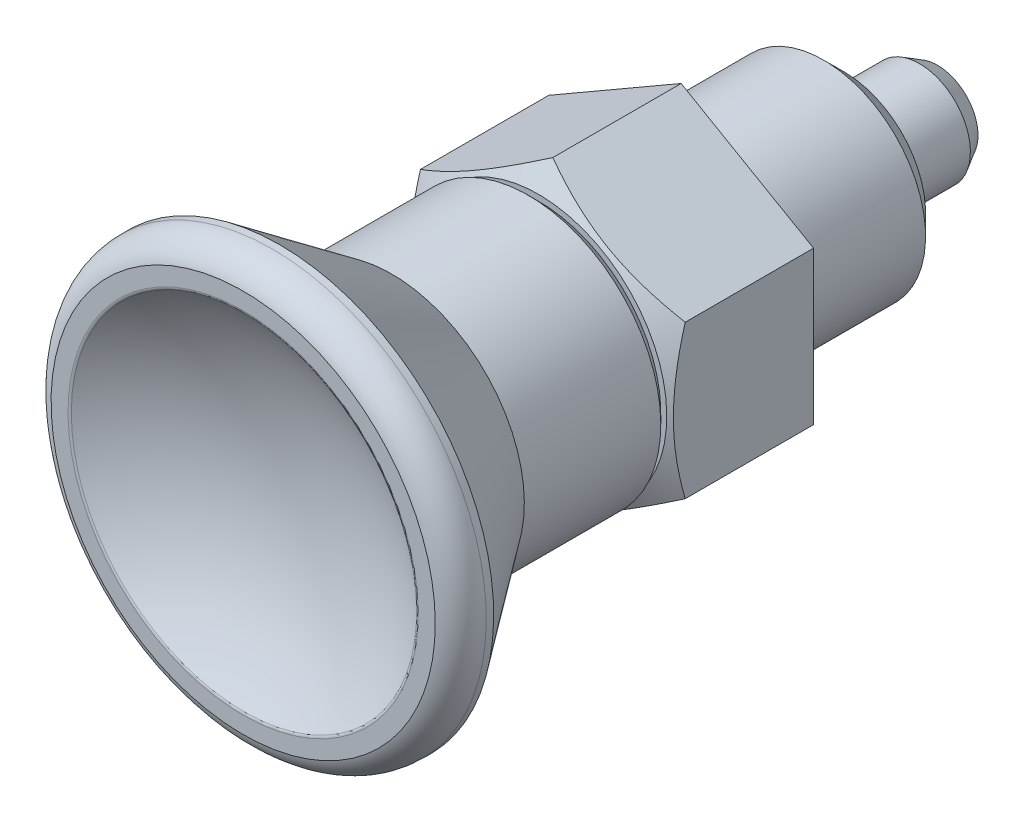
ISO-10303-21;
HEADER;
FILE_DESCRIPTION(('STEP AP214'),'2;1');
FILE_NAME('part.step','',(''),(''),'','','');
FILE_SCHEMA(('AUTOMOTIVE_DESIGN { 1 0 10303 214 1 1 1 1 }'));
ENDSEC;
DATA;
#1=APPLICATION_CONTEXT('core data for automotive mechanical design processes');
#2=APPLICATION_PROTOCOL_DEFINITION('international standard','automotive_design',2000,#1);
#3=PRODUCT_CONTEXT('',#1,'mechanical');
#4=PRODUCT('Part','Part','',(#3));
#5=PRODUCT_RELATED_PRODUCT_CATEGORY('part','',(#4));
#6=PRODUCT_DEFINITION_FORMATION('','',#4);
#7=PRODUCT_DEFINITION_CONTEXT('part definition',#1,'design');
#8=PRODUCT_DEFINITION('design','',#6,#7);
#9=PRODUCT_DEFINITION_SHAPE('','',#8);
#10=(LENGTH_UNIT() NAMED_UNIT(*) SI_UNIT(.MILLI.,.METRE.));
#11=(NAMED_UNIT(*) PLANE_ANGLE_UNIT() SI_UNIT($,.RADIAN.));
#12=(NAMED_UNIT(*) SI_UNIT($,.STERADIAN.) SOLID_ANGLE_UNIT());
#13=UNCERTAINTY_MEASURE_WITH_UNIT(LENGTH_MEASURE(1.E-05),#10,'distance_accuracy_value','');
#14=(GEOMETRIC_REPRESENTATION_CONTEXT(3) GLOBAL_UNCERTAINTY_ASSIGNED_CONTEXT((#13)) GLOBAL_UNIT_ASSIGNED_CONTEXT((#10,
#11,#12)) REPRESENTATION_CONTEXT('',''));
#15=CARTESIAN_POINT('',(0.,0.,0.));
#16=DIRECTION('',(0.,0.,1.));
#17=DIRECTION('',(1.,0.,0.));
#18=AXIS2_PLACEMENT_3D('',#15,#16,#17);
#19=CARTESIAN_POINT('',(0.,0.,-8.));
#20=DIRECTION('',(0.,0.,1.));
#21=DIRECTION('',(-0.866025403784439,0.5,0.));
#22=AXIS2_PLACEMENT_3D('',#19,#20,#21);
#23=CONICAL_SURFACE('',#22,4.,0.785398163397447);
#24=CARTESIAN_POINT('',(0.,0.,-7.));
#25=DIRECTION('',(0.,0.,-1.));
#26=DIRECTION('',(0.866025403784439,-0.5,0.));
#27=AXIS2_PLACEMENT_3D('',#24,#25,#26);
#28=CIRCLE('',#27,5.);
#29=CARTESIAN_POINT('',(4.3301270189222,-2.50000000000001,-7.));
#30=VERTEX_POINT('',#29);
#31=EDGE_CURVE('E120',#30,#30,#28,.F.);
#32=ORIENTED_EDGE('',*,*,#31,.F.);
#33=EDGE_LOOP('',(#32));
#34=FACE_BOUND('',#33,.T.);
#35=CARTESIAN_POINT('',(0.,0.,-8.));
#36=DIRECTION('',(0.,0.,-1.));
#37=DIRECTION('',(0.5,0.866025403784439,0.));
#38=AXIS2_PLACEMENT_3D('',#35,#36,#37);
#39=CIRCLE('',#38,4.);
#40=CARTESIAN_POINT('',(2.,3.46410161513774,-8.));
#41=VERTEX_POINT('',#40);
#42=EDGE_CURVE('E117',#41,#41,#39,.T.);
#43=ORIENTED_EDGE('',*,*,#42,.F.);
#44=EDGE_LOOP('',(#43));
#45=FACE_BOUND('',#44,.T.);
#46=ADVANCED_FACE('F14',(#34,#45),#23,.T.);
#47=CARTESIAN_POINT('',(0.,0.,0.));
#48=DIRECTION('',(0.,0.,-1.));
#49=DIRECTION('',(0.86602540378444,-0.5,0.));
#50=AXIS2_PLACEMENT_3D('',#47,#48,#49);
#51=CYLINDRICAL_SURFACE('',#50,5.);
#52=ORIENTED_EDGE('',*,*,#31,.T.);
#53=EDGE_LOOP('',(#52));
#54=FACE_BOUND('',#53,.T.);
#55=CARTESIAN_POINT('',(0.,0.,0.));
#56=DIRECTION('',(0.,0.,1.));
#57=DIRECTION('',(0.86602540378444,-0.5,0.));
#58=AXIS2_PLACEMENT_3D('',#55,#56,#57);
#59=CIRCLE('',#58,5.);
#60=CARTESIAN_POINT('',(4.3301270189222,-2.50000000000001,0.));
#61=VERTEX_POINT('',#60);
#62=EDGE_CURVE('E110',#61,#61,#59,.T.);
#63=ORIENTED_EDGE('',*,*,#62,.F.);
#64=EDGE_LOOP('',(#63));
#65=FACE_BOUND('',#64,.T.);
#66=ADVANCED_FACE('F176',(#54,#65),#51,.T.);
#67=CARTESIAN_POINT('',(12.3236514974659,1.5451905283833,0.));
#68=DIRECTION('',(0.,0.,-1.));
#69=DIRECTION('',(-0.5,-0.866025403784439,0.));
#70=AXIS2_PLACEMENT_3D('',#67,#68,#69);
#71=PLANE('',#70);
#72=DIRECTION('',(-0.866025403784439,0.5,0.));
#73=VECTOR('',#72,1.);
#74=CARTESIAN_POINT('',(0.,-7.50555349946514,0.));
#75=LINE('',#74,#73);
#76=CARTESIAN_POINT('',(0.,-7.50555349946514,0.));
#77=VERTEX_POINT('',#76);
#78=CARTESIAN_POINT('',(-6.5,-3.75277674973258,0.));
#79=VERTEX_POINT('',#78);
#80=EDGE_CURVE('E338',#77,#79,#75,.T.);
#81=ORIENTED_EDGE('',*,*,#80,.T.);
#82=DIRECTION('',(0.,1.,0.));
#83=VECTOR('',#82,1.);
#84=CARTESIAN_POINT('',(-6.5,-3.75277674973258,0.));
#85=LINE('',#84,#83);
#86=CARTESIAN_POINT('',(-6.5,3.75277674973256,0.));
#87=VERTEX_POINT('',#86);
#88=EDGE_CURVE('E344',#79,#87,#85,.T.);
#89=ORIENTED_EDGE('',*,*,#88,.T.);
#90=DIRECTION('',(0.866025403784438,0.5,0.));
#91=VECTOR('',#90,1.);
#92=CARTESIAN_POINT('',(-6.5,3.75277674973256,0.));
#93=LINE('',#92,#91);
#94=CARTESIAN_POINT('',(0.,7.50555349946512,0.));
#95=VERTEX_POINT('',#94);
#96=EDGE_CURVE('E80',#87,#95,#93,.T.);
#97=ORIENTED_EDGE('',*,*,#96,.T.);
#98=DIRECTION('',(0.866025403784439,-0.5,0.));
#99=VECTOR('',#98,1.);
#100=CARTESIAN_POINT('',(0.,7.50555349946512,0.));
#101=LINE('',#100,#99);
#102=CARTESIAN_POINT('',(6.5,3.75277674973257,0.));
#103=VERTEX_POINT('',#102);
#104=EDGE_CURVE('E85',#95,#103,#101,.T.);
#105=ORIENTED_EDGE('',*,*,#104,.T.);
#106=DIRECTION('',(0.,-1.,0.));
#107=VECTOR('',#106,1.);
#108=CARTESIAN_POINT('',(6.5,3.75277674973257,0.));
#109=LINE('',#108,#107);
#110=CARTESIAN_POINT('',(6.5,-3.75277674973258,0.));
#111=VERTEX_POINT('',#110);
#112=EDGE_CURVE('E89',#103,#111,#109,.T.);
#113=ORIENTED_EDGE('',*,*,#112,.T.);
#114=DIRECTION('',(-0.866025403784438,-0.5,0.));
#115=VECTOR('',#114,1.);
#116=CARTESIAN_POINT('',(6.5,-3.75277674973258,0.));
#117=LINE('',#116,#115);
#118=EDGE_CURVE('E105',#111,#77,#117,.T.);
#119=ORIENTED_EDGE('',*,*,#118,.T.);
#120=EDGE_LOOP('',(#81,#89,#97,#105,#113,#119));
#121=FACE_BOUND('',#120,.T.);
#122=ORIENTED_EDGE('',*,*,#62,.T.);
#123=EDGE_LOOP('',(#122));
#124=FACE_BOUND('',#123,.T.);
#125=ADVANCED_FACE('F86',(#121,#124),#71,.T.);
#126=CARTESIAN_POINT('',(0.,-7.50555349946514,7.));
#127=DIRECTION('',(-0.5,0.866025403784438,0.));
#128=DIRECTION('',(0.866025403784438,0.5,0.));
#129=AXIS2_PLACEMENT_3D('',#126,#127,#128);
#130=PLANE('',#129);
#131=DIRECTION('',(0.,0.,1.));
#132=VECTOR('',#131,1.);
#133=CARTESIAN_POINT('',(0.,-7.50555349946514,0.));
#134=LINE('',#133,#132);
#135=CARTESIAN_POINT('',(0.,-7.50555349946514,6.3));
#136=VERTEX_POINT('',#135);
#137=EDGE_CURVE('E328',#77,#136,#134,.T.);
#138=ORIENTED_EDGE('',*,*,#137,.F.);
#139=ORIENTED_EDGE('',*,*,#118,.F.);
#140=DIRECTION('',(0.,0.,-1.));
#141=VECTOR('',#140,1.);
#142=CARTESIAN_POINT('',(6.5,-3.75277674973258,6.3));
#143=LINE('',#142,#141);
#144=CARTESIAN_POINT('',(6.5,-3.75277674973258,6.3));
#145=VERTEX_POINT('',#144);
#146=EDGE_CURVE('E99',#145,#111,#143,.T.);
#147=ORIENTED_EDGE('',*,*,#146,.F.);
#148=CARTESIAN_POINT('',(0.,-7.50555349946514,6.3));
#149=CARTESIAN_POINT('',(3.25000000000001,-5.62916512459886,7.38333333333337));
#150=CARTESIAN_POINT('',(6.5,-3.75277674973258,6.3));
#151=(BOUNDED_CURVE() B_SPLINE_CURVE(2,(#148,#149,#150),.UNSPECIFIED.,.F.,
.F.) B_SPLINE_CURVE_WITH_KNOTS((3,3),(0.,1.),
.UNSPECIFIED.) CURVE() GEOMETRIC_REPRESENTATION_ITEM() RATIONAL_B_SPLINE_CURVE((1.,
1.15470053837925,1.)) REPRESENTATION_ITEM(''));
#152=EDGE_CURVE('E318',#136,#145,#151,.T.);
#153=ORIENTED_EDGE('',*,*,#152,.F.);
#154=EDGE_LOOP('',(#138,#139,#147,#153));
#155=FACE_BOUND('',#154,.T.);
#156=ADVANCED_FACE('F182',(#155),#130,.F.);
#157=CARTESIAN_POINT('',(-6.5,-3.75277674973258,7.));
#158=DIRECTION('',(0.5,0.866025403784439,0.));
#159=DIRECTION('',(0.866025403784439,-0.5,0.));
#160=AXIS2_PLACEMENT_3D('',#157,#158,#159);
#161=PLANE('',#160);
#162=DIRECTION('',(0.,0.,-1.));
#163=VECTOR('',#162,1.);
#164=CARTESIAN_POINT('',(-6.5,-3.75277674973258,6.3));
#165=LINE('',#164,#163);
#166=CARTESIAN_POINT('',(-6.5,-3.75277674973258,6.3));
#167=VERTEX_POINT('',#166);
#168=EDGE_CURVE('E327',#167,#79,#165,.T.);
#169=ORIENTED_EDGE('',*,*,#168,.T.);
#170=ORIENTED_EDGE('',*,*,#80,.F.);
#171=ORIENTED_EDGE('',*,*,#137,.T.);
#172=CARTESIAN_POINT('',(-6.5,-3.75277674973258,6.3));
#173=CARTESIAN_POINT('',(-3.24999999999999,-5.62916512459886,7.38333333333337));
#174=CARTESIAN_POINT('',(0.,-7.50555349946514,6.3));
#175=(BOUNDED_CURVE() B_SPLINE_CURVE(2,(#172,#173,#174),.UNSPECIFIED.,.F.,
.F.) B_SPLINE_CURVE_WITH_KNOTS((3,3),(0.,1.),
.UNSPECIFIED.) CURVE() GEOMETRIC_REPRESENTATION_ITEM() RATIONAL_B_SPLINE_CURVE((1.,
1.15470053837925,1.)) REPRESENTATION_ITEM(''));
#176=EDGE_CURVE('E309',#167,#136,#175,.T.);
#177=ORIENTED_EDGE('',*,*,#176,.F.);
#178=EDGE_LOOP('',(#169,#170,#171,#177));
#179=FACE_BOUND('',#178,.T.);
#180=ADVANCED_FACE('F189',(#179),#161,.F.);
#181=CARTESIAN_POINT('',(-6.5,3.75277674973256,7.));
#182=DIRECTION('',(1.,0.,0.));
#183=DIRECTION('',(0.,-1.,0.));
#184=AXIS2_PLACEMENT_3D('',#181,#182,#183);
#185=PLANE('',#184);
#186=DIRECTION('',(0.,0.,-1.));
#187=VECTOR('',#186,1.);
#188=CARTESIAN_POINT('',(-6.5,3.75277674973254,6.3));
#189=LINE('',#188,#187);
#190=CARTESIAN_POINT('',(-6.5,3.75277674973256,6.3));
#191=VERTEX_POINT('',#190);
#192=EDGE_CURVE('E334',#191,#87,#189,.T.);
#193=ORIENTED_EDGE('',*,*,#192,.T.);
#194=ORIENTED_EDGE('',*,*,#88,.F.);
#195=ORIENTED_EDGE('',*,*,#168,.F.);
#196=CARTESIAN_POINT('',(-6.5,3.75277674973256,6.3));
#197=CARTESIAN_POINT('',(-6.5,0.,7.38333333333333));
#198=CARTESIAN_POINT('',(-6.5,-3.75277674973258,6.3));
#199=(BOUNDED_CURVE() B_SPLINE_CURVE(2,(#196,#197,#198),.UNSPECIFIED.,.F.,
.F.) B_SPLINE_CURVE_WITH_KNOTS((3,3),(0.,1.),
.UNSPECIFIED.) CURVE() GEOMETRIC_REPRESENTATION_ITEM() RATIONAL_B_SPLINE_CURVE((1.,
1.15470053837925,1.)) REPRESENTATION_ITEM(''));
#200=EDGE_CURVE('E300',#191,#167,#199,.T.);
#201=ORIENTED_EDGE('',*,*,#200,.F.);
#202=EDGE_LOOP('',(#193,#194,#195,#201));
#203=FACE_BOUND('',#202,.T.);
#204=ADVANCED_FACE('F433',(#203),#185,.F.);
#205=CARTESIAN_POINT('',(0.,7.50555349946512,7.));
#206=DIRECTION('',(0.5,-0.866025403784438,0.));
#207=DIRECTION('',(-0.866025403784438,-0.5,0.));
#208=AXIS2_PLACEMENT_3D('',#205,#206,#207);
#209=PLANE('',#208);
#210=DIRECTION('',(0.,0.,-1.));
#211=VECTOR('',#210,1.);
#212=CARTESIAN_POINT('',(0.,7.50555349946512,6.3));
#213=LINE('',#212,#211);
#214=CARTESIAN_POINT('',(0.,7.50555349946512,6.3));
#215=VERTEX_POINT('',#214);
#216=EDGE_CURVE('E98',#215,#95,#213,.T.);
#217=ORIENTED_EDGE('',*,*,#216,.T.);
#218=ORIENTED_EDGE('',*,*,#96,.F.);
#219=ORIENTED_EDGE('',*,*,#192,.F.);
#220=CARTESIAN_POINT('',(0.,7.50555349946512,6.3));
#221=CARTESIAN_POINT('',(-3.25000000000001,5.62916512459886,7.38333333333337));
#222=CARTESIAN_POINT('',(-6.5,3.75277674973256,6.3));
#223=(BOUNDED_CURVE() B_SPLINE_CURVE(2,(#220,#221,#222),.UNSPECIFIED.,.F.,
.F.) B_SPLINE_CURVE_WITH_KNOTS((3,3),(0.,1.),
.UNSPECIFIED.) CURVE() GEOMETRIC_REPRESENTATION_ITEM() RATIONAL_B_SPLINE_CURVE((1.,
1.15470053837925,1.)) REPRESENTATION_ITEM(''));
#224=EDGE_CURVE('E291',#215,#191,#223,.T.);
#225=ORIENTED_EDGE('',*,*,#224,.F.);
#226=EDGE_LOOP('',(#217,#218,#219,#225));
#227=FACE_BOUND('',#226,.T.);
#228=ADVANCED_FACE('F445',(#227),#209,.F.);
#229=CARTESIAN_POINT('',(6.5,3.75277674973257,7.));
#230=DIRECTION('',(-0.5,-0.866025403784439,0.));
#231=DIRECTION('',(-0.866025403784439,0.5,0.));
#232=AXIS2_PLACEMENT_3D('',#229,#230,#231);
#233=PLANE('',#232);
#234=DIRECTION('',(0.,0.,-1.));
#235=VECTOR('',#234,1.);
#236=CARTESIAN_POINT('',(6.5,3.75277674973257,6.3));
#237=LINE('',#236,#235);
#238=CARTESIAN_POINT('',(6.5,3.75277674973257,6.3));
#239=VERTEX_POINT('',#238);
#240=EDGE_CURVE('E93',#239,#103,#237,.T.);
#241=ORIENTED_EDGE('',*,*,#240,.T.);
#242=ORIENTED_EDGE('',*,*,#104,.F.);
#243=ORIENTED_EDGE('',*,*,#216,.F.);
#244=CARTESIAN_POINT('',(6.5,3.75277674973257,6.3));
#245=CARTESIAN_POINT('',(3.25000000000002,5.62916512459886,7.38333333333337));
#246=CARTESIAN_POINT('',(0.,7.50555349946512,6.3));
#247=(BOUNDED_CURVE() B_SPLINE_CURVE(2,(#244,#245,#246),.UNSPECIFIED.,.F.,
.F.) B_SPLINE_CURVE_WITH_KNOTS((3,3),(0.,1.),
.UNSPECIFIED.) CURVE() GEOMETRIC_REPRESENTATION_ITEM() RATIONAL_B_SPLINE_CURVE((1.,
1.15470053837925,1.)) REPRESENTATION_ITEM(''));
#248=EDGE_CURVE('E38',#239,#215,#247,.T.);
#249=ORIENTED_EDGE('',*,*,#248,.F.);
#250=EDGE_LOOP('',(#241,#242,#243,#249));
#251=FACE_BOUND('',#250,.T.);
#252=ADVANCED_FACE('F94',(#251),#233,.F.);
#253=CARTESIAN_POINT('',(6.5,-3.75277674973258,7.));
#254=DIRECTION('',(-1.,0.,0.));
#255=DIRECTION('',(0.,1.,0.));
#256=AXIS2_PLACEMENT_3D('',#253,#254,#255);
#257=PLANE('',#256);
#258=ORIENTED_EDGE('',*,*,#146,.T.);
#259=ORIENTED_EDGE('',*,*,#112,.F.);
#260=ORIENTED_EDGE('',*,*,#240,.F.);
#261=CARTESIAN_POINT('',(6.5,-3.75277674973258,6.3));
#262=CARTESIAN_POINT('',(6.49999999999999,0.,7.38333333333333));
#263=CARTESIAN_POINT('',(6.5,3.75277674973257,6.3));
#264=(BOUNDED_CURVE() B_SPLINE_CURVE(2,(#261,#262,#263),.UNSPECIFIED.,.F.,
.F.) B_SPLINE_CURVE_WITH_KNOTS((3,3),(0.,1.),
.UNSPECIFIED.) CURVE() GEOMETRIC_REPRESENTATION_ITEM() RATIONAL_B_SPLINE_CURVE((1.,
1.15470053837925,1.)) REPRESENTATION_ITEM(''));
#265=EDGE_CURVE('E279',#145,#239,#264,.T.);
#266=ORIENTED_EDGE('',*,*,#265,.F.);
#267=EDGE_LOOP('',(#258,#259,#260,#266));
#268=FACE_BOUND('',#267,.T.);
#269=ADVANCED_FACE('F102',(#268),#257,.F.);
#270=CARTESIAN_POINT('',(0.,0.,7.));
#271=DIRECTION('',(0.,0.,-1.));
#272=DIRECTION('',(0.866025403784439,-0.5,0.));
#273=AXIS2_PLACEMENT_3D('',#270,#271,#272);
#274=CONICAL_SURFACE('',#273,6.29311793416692,1.0471975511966);
#275=ORIENTED_EDGE('',*,*,#265,.T.);
#276=ORIENTED_EDGE('',*,*,#248,.T.);
#277=ORIENTED_EDGE('',*,*,#224,.T.);
#278=ORIENTED_EDGE('',*,*,#200,.T.);
#279=ORIENTED_EDGE('',*,*,#176,.T.);
#280=ORIENTED_EDGE('',*,*,#152,.T.);
#281=EDGE_LOOP('',(#275,#276,#277,#278,#279,#280));
#282=FACE_BOUND('',#281,.T.);
#283=CARTESIAN_POINT('',(0.,0.,7.));
#284=DIRECTION('',(0.,0.,1.));
#285=DIRECTION('',(0.866025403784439,-0.5,0.));
#286=AXIS2_PLACEMENT_3D('',#283,#284,#285);
#287=CIRCLE('',#286,6.29311793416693);
#288=CARTESIAN_POINT('',(5.45000000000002,-3.14655896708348,7.));
#289=VERTEX_POINT('',#288);
#290=EDGE_CURVE('E121',#289,#289,#287,.T.);
#291=ORIENTED_EDGE('',*,*,#290,.F.);
#292=EDGE_LOOP('',(#291));
#293=FACE_BOUND('',#292,.T.);
#294=ADVANCED_FACE('F173',(#282,#293),#274,.T.);
#295=CARTESIAN_POINT('',(-2.56602540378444,10.1417494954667,7.));
#296=DIRECTION('',(0.,0.,1.));
#297=DIRECTION('',(-0.5,-0.866025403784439,0.));
#298=AXIS2_PLACEMENT_3D('',#295,#296,#297);
#299=PLANE('',#298);
#300=CARTESIAN_POINT('',(0.,0.,7.));
#301=DIRECTION('',(0.,0.,-1.));
#302=DIRECTION('',(0.86602540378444,-0.5,0.));
#303=AXIS2_PLACEMENT_3D('',#300,#301,#302);
#304=CIRCLE('',#303,6.);
#305=CARTESIAN_POINT('',(5.19615242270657,-2.99999999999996,7.));
#306=VERTEX_POINT('',#305);
#307=EDGE_CURVE('E9',#306,#306,#304,.T.);
#308=ORIENTED_EDGE('',*,*,#307,.T.);
#309=EDGE_LOOP('',(#308));
#310=FACE_BOUND('',#309,.T.);
#311=ORIENTED_EDGE('',*,*,#290,.T.);
#312=EDGE_LOOP('',(#311));
#313=FACE_BOUND('',#312,.T.);
#314=ADVANCED_FACE('F162',(#310,#313),#299,.T.);
#315=CARTESIAN_POINT('',(-1.18111959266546E-13,0.,32.6055276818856));
#316=DIRECTION('',(0.,0.,-1.));
#317=DIRECTION('',(0.866025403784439,-0.5,0.));
#318=AXIS2_PLACEMENT_3D('',#315,#316,#317);
#319=SPHERICAL_SURFACE('',#318,14.0000000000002);
#320=CARTESIAN_POINT('',(0.,0.,21.4646826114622));
#321=DIRECTION('',(0.,0.,-1.));
#322=DIRECTION('',(0.866025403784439,-0.5,0.));
#323=AXIS2_PLACEMENT_3D('',#320,#321,#322);
#324=CIRCLE('',#323,8.47830001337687);
#325=CARTESIAN_POINT('',(7.34242319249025,-4.23915000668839,21.4646826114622));
#326=VERTEX_POINT('',#325);
#327=EDGE_CURVE('E18',#326,#326,#324,.T.);
#328=ORIENTED_EDGE('',*,*,#327,.F.);
#329=EDGE_LOOP('',(#328));
#330=FACE_BOUND('',#329,.T.);
#331=ADVANCED_FACE('F160',(#330),#319,.F.);
#332=CARTESIAN_POINT('',(0.,0.,21.3055276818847));
#333=DIRECTION('',(0.,0.,-1.));
#334=DIRECTION('',(-1.,0.,0.));
#335=AXIS2_PLACEMENT_3D('',#332,#333,#334);
#336=TOROIDAL_SURFACE('',#335,8.59941858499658,0.200000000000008);
#337=ORIENTED_EDGE('',*,*,#327,.T.);
#338=EDGE_LOOP('',(#337));
#339=FACE_BOUND('',#338,.T.);
#340=CARTESIAN_POINT('',(0.,0.,21.5055276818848));
#341=DIRECTION('',(0.,0.,1.));
#342=DIRECTION('',(0.86602540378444,-0.5,0.));
#343=AXIS2_PLACEMENT_3D('',#340,#341,#342);
#344=CIRCLE('',#343,8.59941858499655);
#345=CARTESIAN_POINT('',(7.44731495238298,-4.29970929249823,21.5055276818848));
#346=VERTEX_POINT('',#345);
#347=EDGE_CURVE('E123',#346,#346,#344,.T.);
#348=ORIENTED_EDGE('',*,*,#347,.T.);
#349=EDGE_LOOP('',(#348));
#350=FACE_BOUND('',#349,.T.);
#351=ADVANCED_FACE('F158',(#339,#350),#336,.T.);
#352=CARTESIAN_POINT('',(-14.1723443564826,-3.79746822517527,21.5055276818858));
#353=DIRECTION('',(0.,0.,1.));
#354=DIRECTION('',(0.866025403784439,-0.5,0.));
#355=AXIS2_PLACEMENT_3D('',#352,#353,#354);
#356=PLANE('',#355);
#357=CARTESIAN_POINT('',(0.,0.,21.5055276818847));
#358=DIRECTION('',(0.,0.,-1.));
#359=DIRECTION('',(0.866025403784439,-0.5,0.));
#360=AXIS2_PLACEMENT_3D('',#357,#358,#359);
#361=CIRCLE('',#360,9.43170557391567);
#362=CARTESIAN_POINT('',(8.16809662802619,-4.71585278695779,21.5055276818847));
#363=VERTEX_POINT('',#362);
#364=EDGE_CURVE('E140',#363,#363,#361,.T.);
#365=ORIENTED_EDGE('',*,*,#364,.F.);
#366=EDGE_LOOP('',(#365));
#367=FACE_BOUND('',#366,.T.);
#368=ORIENTED_EDGE('',*,*,#347,.F.);
#369=EDGE_LOOP('',(#368));
#370=FACE_BOUND('',#369,.T.);
#371=ADVANCED_FACE('F171',(#367,#370),#356,.T.);
#372=CARTESIAN_POINT('',(0.,0.,20.0689935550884));
#373=DIRECTION('',(0.,0.,-1.));
#374=DIRECTION('',(0.,1.,0.));
#375=AXIS2_PLACEMENT_3D('',#372,#373,#374);
#376=TOROIDAL_SURFACE('',#375,8.99999999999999,1.50000000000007);
#377=ORIENTED_EDGE('',*,*,#364,.T.);
#378=EDGE_LOOP('',(#377));
#379=FACE_BOUND('',#378,.T.);
#380=CARTESIAN_POINT('',(0.,0.,20.0689935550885));
#381=DIRECTION('',(0.,0.,-1.));
#382=DIRECTION('',(0.866025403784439,-0.5,0.));
#383=AXIS2_PLACEMENT_3D('',#380,#381,#382);
#384=CIRCLE('',#383,10.5);
#385=CARTESIAN_POINT('',(9.09326673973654,-5.24999999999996,20.0689935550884));
#386=VERTEX_POINT('',#385);
#387=EDGE_CURVE('E136',#386,#386,#384,.T.);
#388=ORIENTED_EDGE('',*,*,#387,.F.);
#389=EDGE_LOOP('',(#388));
#390=FACE_BOUND('',#389,.T.);
#391=ADVANCED_FACE('F212',(#379,#390),#376,.T.);
#392=CARTESIAN_POINT('',(0.,0.,20.0689935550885));
#393=DIRECTION('',(0.,0.,-1.));
#394=DIRECTION('',(0.86602540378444,-0.5,0.));
#395=AXIS2_PLACEMENT_3D('',#392,#393,#394);
#396=CYLINDRICAL_SURFACE('',#395,10.5);
#397=ORIENTED_EDGE('',*,*,#387,.T.);
#398=EDGE_LOOP('',(#397));
#399=FACE_BOUND('',#398,.T.);
#400=CARTESIAN_POINT('',(0.,0.,19.7055276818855));
#401=DIRECTION('',(0.,0.,-1.));
#402=DIRECTION('',(0.866025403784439,-0.5,0.));
#403=AXIS2_PLACEMENT_3D('',#400,#401,#402);
#404=CIRCLE('',#403,10.5);
#405=CARTESIAN_POINT('',(9.09326673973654,-5.24999999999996,19.7055276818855));
#406=VERTEX_POINT('',#405);
#407=EDGE_CURVE('E132',#406,#406,#404,.T.);
#408=ORIENTED_EDGE('',*,*,#407,.F.);
#409=EDGE_LOOP('',(#408));
#410=FACE_BOUND('',#409,.T.);
#411=ADVANCED_FACE('F209',(#399,#410),#396,.T.);
#412=CARTESIAN_POINT('',(0.,0.,14.2));
#413=DIRECTION('',(0.,0.,1.));
#414=DIRECTION('',(0.866025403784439,-0.5,0.));
#415=AXIS2_PLACEMENT_3D('',#412,#413,#414);
#416=CONICAL_SURFACE('',#415,6.5,0.628318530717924);
#417=ORIENTED_EDGE('',*,*,#407,.T.);
#418=EDGE_LOOP('',(#417));
#419=FACE_BOUND('',#418,.T.);
#420=CARTESIAN_POINT('',(0.,0.,14.2));
#421=DIRECTION('',(0.,0.,-1.));
#422=DIRECTION('',(0.86602540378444,-0.5,0.));
#423=AXIS2_PLACEMENT_3D('',#420,#421,#422);
#424=CIRCLE('',#423,6.5);
#425=CARTESIAN_POINT('',(5.62916512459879,-3.24999999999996,14.2));
#426=VERTEX_POINT('',#425);
#427=EDGE_CURVE('E128',#426,#426,#424,.T.);
#428=ORIENTED_EDGE('',*,*,#427,.F.);
#429=EDGE_LOOP('',(#428));
#430=FACE_BOUND('',#429,.T.);
#431=ADVANCED_FACE('F205',(#419,#430),#416,.T.);
#432=CARTESIAN_POINT('',(0.,0.,14.2));
#433=DIRECTION('',(0.,0.,-1.));
#434=DIRECTION('',(0.86602540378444,-0.5,0.));
#435=AXIS2_PLACEMENT_3D('',#432,#433,#434);
#436=CYLINDRICAL_SURFACE('',#435,6.5);
#437=CARTESIAN_POINT('',(0.,0.,7.5));
#438=DIRECTION('',(0.,0.,1.));
#439=DIRECTION('',(0.86602540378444,-0.5,0.));
#440=AXIS2_PLACEMENT_3D('',#437,#438,#439);
#441=CIRCLE('',#440,6.5);
#442=CARTESIAN_POINT('',(5.62916512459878,-3.24999999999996,7.5));
#443=VERTEX_POINT('',#442);
#444=EDGE_CURVE('E24',#443,#443,#441,.T.);
#445=ORIENTED_EDGE('',*,*,#444,.T.);
#446=EDGE_LOOP('',(#445));
#447=FACE_BOUND('',#446,.T.);
#448=ORIENTED_EDGE('',*,*,#427,.T.);
#449=EDGE_LOOP('',(#448));
#450=FACE_BOUND('',#449,.T.);
#451=ADVANCED_FACE('F201',(#447,#450),#436,.T.);
#452=CARTESIAN_POINT('',(0.,0.,7.));
#453=DIRECTION('',(0.,0.,1.));
#454=DIRECTION('',(0.86602540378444,-0.5,0.));
#455=AXIS2_PLACEMENT_3D('',#452,#453,#454);
#456=CONICAL_SURFACE('',#455,6.,0.785398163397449);
#457=ORIENTED_EDGE('',*,*,#444,.F.);
#458=EDGE_LOOP('',(#457));
#459=FACE_BOUND('',#458,.T.);
#460=ORIENTED_EDGE('',*,*,#307,.F.);
#461=EDGE_LOOP('',(#460));
#462=FACE_BOUND('',#461,.T.);
#463=ADVANCED_FACE('F197',(#459,#462),#456,.T.);
#464=CARTESIAN_POINT('',(0.,0.,-8.));
#465=DIRECTION('',(0.,0.,-1.));
#466=DIRECTION('',(-0.866025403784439,0.5,0.));
#467=AXIS2_PLACEMENT_3D('',#464,#465,#466);
#468=SPHERICAL_SURFACE('',#467,5.00000000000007);
#469=CARTESIAN_POINT('',(0.,0.,-12.588122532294));
#470=DIRECTION('',(0.,0.,1.));
#471=DIRECTION('',(-0.86602540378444,0.5,0.));
#472=AXIS2_PLACEMENT_3D('',#469,#470,#471);
#473=CIRCLE('',#472,1.9872422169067);
#474=CARTESIAN_POINT('',(-1.7210022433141,0.993621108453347,-12.588122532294));
#475=VERTEX_POINT('',#474);
#476=EDGE_CURVE('E273',#475,#475,#473,.T.);
#477=ORIENTED_EDGE('',*,*,#476,.F.);
#478=EDGE_LOOP('',(#477));
#479=FACE_BOUND('',#478,.T.);
#480=ADVANCED_FACE('F200',(#479),#468,.T.);
#481=CARTESIAN_POINT('',(0.,0.,-12.588122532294));
#482=DIRECTION('',(0.,0.,1.));
#483=DIRECTION('',(-0.86602540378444,0.5,0.));
#484=AXIS2_PLACEMENT_3D('',#481,#482,#483);
#485=CONICAL_SURFACE('',#484,1.9872422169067,0.523598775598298);
#486=CARTESIAN_POINT('',(0.,0.,-11.7));
#487=DIRECTION('',(0.,0.,1.));
#488=DIRECTION('',(-0.86602540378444,0.5,0.));
#489=AXIS2_PLACEMENT_3D('',#486,#487,#488);
#490=CIRCLE('',#489,2.5);
#491=CARTESIAN_POINT('',(-2.1650635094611,1.25,-11.7));
#492=VERTEX_POINT('',#491);
#493=EDGE_CURVE('E266',#492,#492,#490,.T.);
#494=ORIENTED_EDGE('',*,*,#493,.F.);
#495=EDGE_LOOP('',(#494));
#496=FACE_BOUND('',#495,.T.);
#497=ORIENTED_EDGE('',*,*,#476,.T.);
#498=EDGE_LOOP('',(#497));
#499=FACE_BOUND('',#498,.T.);
#500=ADVANCED_FACE('F563',(#496,#499),#485,.T.);
#501=CARTESIAN_POINT('',(0.,0.,-8.5));
#502=DIRECTION('',(0.,0.,-1.));
#503=DIRECTION('',(-0.866025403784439,0.5,0.));
#504=AXIS2_PLACEMENT_3D('',#501,#502,#503);
#505=CYLINDRICAL_SURFACE('',#504,2.5);
#506=CARTESIAN_POINT('',(0.,0.,-8.5));
#507=DIRECTION('',(0.,0.,1.));
#508=DIRECTION('',(-0.86602540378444,0.5,0.));
#509=AXIS2_PLACEMENT_3D('',#506,#507,#508);
#510=CIRCLE('',#509,2.5);
#511=CARTESIAN_POINT('',(-2.1650635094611,1.25,-8.5));
#512=VERTEX_POINT('',#511);
#513=EDGE_CURVE('E257',#512,#512,#510,.T.);
#514=ORIENTED_EDGE('',*,*,#513,.F.);
#515=EDGE_LOOP('',(#514));
#516=FACE_BOUND('',#515,.T.);
#517=ORIENTED_EDGE('',*,*,#493,.T.);
#518=EDGE_LOOP('',(#517));
#519=FACE_BOUND('',#518,.T.);
#520=ADVANCED_FACE('F246',(#516,#519),#505,.T.);
#521=CARTESIAN_POINT('',(0.,0.,-8.37320508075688));
#522=DIRECTION('',(0.,0.,-1.));
#523=DIRECTION('',(-0.866025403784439,0.5,0.));
#524=AXIS2_PLACEMENT_3D('',#521,#522,#523);
#525=CONICAL_SURFACE('',#524,2.42679491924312,0.523598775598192);
#526=CARTESIAN_POINT('',(0.,0.,-8.37320508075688));
#527=DIRECTION('',(0.,0.,1.));
#528=DIRECTION('',(-0.86602540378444,0.5,0.));
#529=AXIS2_PLACEMENT_3D('',#526,#527,#528);
#530=CIRCLE('',#529,2.42679491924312);
#531=CARTESIAN_POINT('',(-2.10166604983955,1.21339745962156,-8.37320508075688));
#532=VERTEX_POINT('',#531);
#533=EDGE_CURVE('E255',#532,#532,#530,.T.);
#534=ORIENTED_EDGE('',*,*,#533,.F.);
#535=EDGE_LOOP('',(#534));
#536=FACE_BOUND('',#535,.T.);
#537=ORIENTED_EDGE('',*,*,#513,.T.);
#538=EDGE_LOOP('',(#537));
#539=FACE_BOUND('',#538,.T.);
#540=ADVANCED_FACE('F237',(#536,#539),#525,.T.);
#541=CARTESIAN_POINT('',(0.,0.,-8.27320508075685));
#542=DIRECTION('',(0.,0.,-1.));
#543=DIRECTION('',(-1.,0.,0.));
#544=AXIS2_PLACEMENT_3D('',#541,#542,#543);
#545=TOROIDAL_SURFACE('',#544,2.60000000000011,0.200000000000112);
#546=CARTESIAN_POINT('',(0.,0.,-8.27320508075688));
#547=DIRECTION('',(0.,0.,1.));
#548=DIRECTION('',(-0.86602540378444,0.5,0.));
#549=AXIS2_PLACEMENT_3D('',#546,#547,#548);
#550=CIRCLE('',#549,2.4);
#551=CARTESIAN_POINT('',(-2.07846096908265,1.2,-8.27320508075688));
#552=VERTEX_POINT('',#551);
#553=EDGE_CURVE('E252',#552,#552,#550,.T.);
#554=ORIENTED_EDGE('',*,*,#553,.F.);
#555=EDGE_LOOP('',(#554));
#556=FACE_BOUND('',#555,.T.);
#557=ORIENTED_EDGE('',*,*,#533,.T.);
#558=EDGE_LOOP('',(#557));
#559=FACE_BOUND('',#558,.T.);
#560=ADVANCED_FACE('F235',(#556,#559),#545,.F.);
#561=CARTESIAN_POINT('',(0.,0.,-8.2));
#562=DIRECTION('',(0.,0.,-1.));
#563=DIRECTION('',(-0.866025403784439,0.5,0.));
#564=AXIS2_PLACEMENT_3D('',#561,#562,#563);
#565=CYLINDRICAL_SURFACE('',#564,2.4);
#566=CARTESIAN_POINT('',(0.,0.,-8.2));
#567=DIRECTION('',(0.,0.,1.));
#568=DIRECTION('',(-0.86602540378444,0.5,0.));
#569=AXIS2_PLACEMENT_3D('',#566,#567,#568);
#570=CIRCLE('',#569,2.4);
#571=CARTESIAN_POINT('',(-2.07846096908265,1.2,-8.2));
#572=VERTEX_POINT('',#571);
#573=EDGE_CURVE('E263',#572,#572,#570,.T.);
#574=ORIENTED_EDGE('',*,*,#573,.F.);
#575=EDGE_LOOP('',(#574));
#576=FACE_BOUND('',#575,.T.);
#577=ORIENTED_EDGE('',*,*,#553,.T.);
#578=EDGE_LOOP('',(#577));
#579=FACE_BOUND('',#578,.T.);
#580=ADVANCED_FACE('F236',(#576,#579),#565,.T.);
#581=CARTESIAN_POINT('',(0.,0.,-8.2));
#582=DIRECTION('',(0.,0.,-1.));
#583=DIRECTION('',(-1.,0.,0.));
#584=AXIS2_PLACEMENT_3D('',#581,#582,#583);
#585=TOROIDAL_SURFACE('',#584,2.6,0.2);
#586=CARTESIAN_POINT('',(0.,0.,-8.));
#587=DIRECTION('',(0.,0.,1.));
#588=DIRECTION('',(-0.86602540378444,0.5,0.));
#589=AXIS2_PLACEMENT_3D('',#586,#587,#588);
#590=CIRCLE('',#589,2.6);
#591=CARTESIAN_POINT('',(-2.25166604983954,1.3,-8.));
#592=VERTEX_POINT('',#591);
#593=EDGE_CURVE('E116',#592,#592,#590,.T.);
#594=ORIENTED_EDGE('',*,*,#593,.F.);
#595=EDGE_LOOP('',(#594));
#596=FACE_BOUND('',#595,.T.);
#597=ORIENTED_EDGE('',*,*,#573,.T.);
#598=EDGE_LOOP('',(#597));
#599=FACE_BOUND('',#598,.T.);
#600=ADVANCED_FACE('F16',(#596,#599),#585,.F.);
#601=CARTESIAN_POINT('',(1.13814662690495,-4.24762103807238,-8.));
#602=DIRECTION('',(0.,0.,-1.));
#603=DIRECTION('',(-0.866025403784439,0.5,0.));
#604=AXIS2_PLACEMENT_3D('',#601,#602,#603);
#605=PLANE('',#604);
#606=ORIENTED_EDGE('',*,*,#593,.T.);
#607=EDGE_LOOP('',(#606));
#608=FACE_BOUND('',#607,.T.);
#609=ORIENTED_EDGE('',*,*,#42,.T.);
#610=EDGE_LOOP('',(#609));
#611=FACE_BOUND('',#610,.T.);
#612=ADVANCED_FACE('F619',(#608,#611),#605,.T.);
#613=CLOSED_SHELL('',(#46,#66,#125,#156,#180,#204,#228,#252,#269,#294,#314,#331,#351,#371,#391,
#411,#431,#451,#463,#480,#500,#520,#540,#560,#580,#600,#612));
#614=MANIFOLD_SOLID_BREP('B1',#613);
#615=ADVANCED_BREP_SHAPE_REPRESENTATION('',(#18,#614),#14);
#616=SHAPE_DEFINITION_REPRESENTATION(#9,#615);
ENDSEC;
END-ISO-10303-21;
